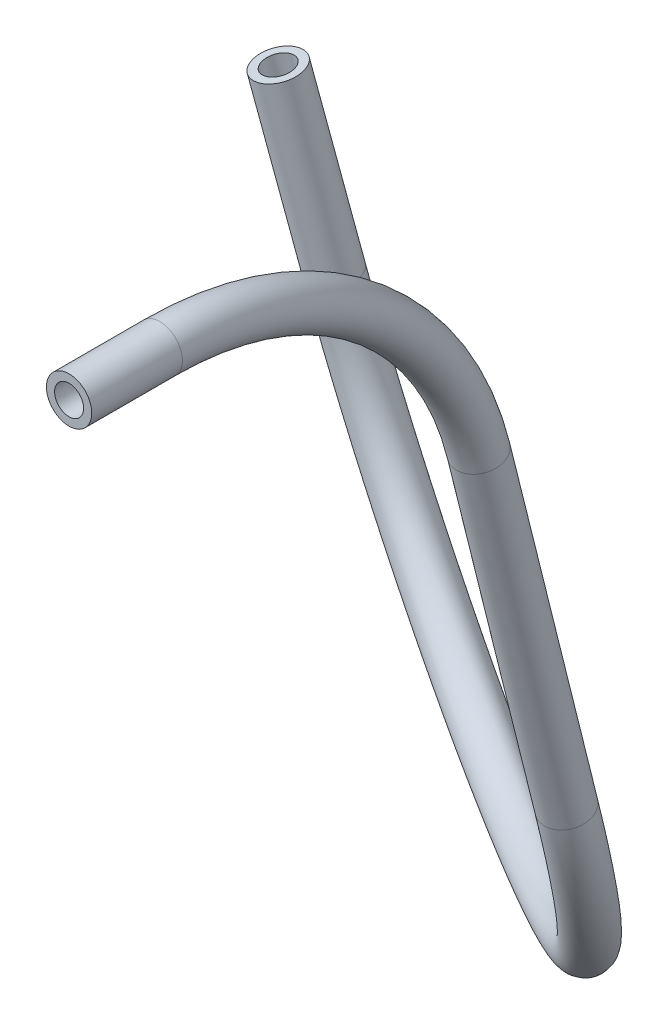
from build123d import *

# Parameters (mm, degrees)
SKETCH2_R           = 1.5875
SKETCH2_R_2         = 1.016
SKETCH5_R           = 1.5875
SKETCH5_R_2         = 1.016
REVOLVE1_ANGLE      = 169
SKETCH6_R           = 1.5875
SKETCH6_R_2         = 1.016
BOSS_EXTRUDE1_DEPTH = 12.7


with BuildPart() as part:
    # Sweep2: sweep along a path in Sketch1
    with BuildLine(Plane(origin=(0, 0, 0), x_dir=(0, 0, -1), z_dir=(1, 0, 0))) as sweep2_path:
        Line((34.829810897, -42.095521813), (28.684994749, -17.450010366))
        ThreePointArc((28.684994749, -17.450010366), (20.521757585, -4.879727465), (6.35, 0))
        Line((6.35, 0), (0, 0))
    # Sketch2 → Sweep2 (sweep)
    with BuildSketch(Plane.XY):
        Circle(SKETCH2_R)
        Circle(SKETCH2_R_2, mode=Mode.SUBTRACT)
    sweep(path=sweep2_path.line)

    # Sketch5 → Revolve1 (revolve)
    with BuildSketch(Plane(origin=(0, -47.807633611, -11.919781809), x_dir=(1, 0, 0), z_dir=(0, -0.9702957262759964, -0.24192189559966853))):
        with Locations(Location((0, -23.611388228, 0), (0, 0, 270))):
            Circle(SKETCH5_R)
        with Locations(Location((0, -23.611388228, 0), (0, 0, 270))):
            Circle(SKETCH5_R_2, mode=Mode.SUBTRACT)
    revolve(axis=Axis((-23.741853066, -40.948617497, -39.429792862), (0.4999999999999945, 0.20951050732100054, -0.840300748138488)), revolution_arc=REVOLVE1_ANGLE)

    # Sketch6 → Boss-Extrude1 (add)
    with BuildSketch(Plane(origin=(6.896979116, -40.717261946, -6.048078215), x_dir=(0.20132463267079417, -0.11046703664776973, 0.9732756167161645), z_dir=(-0.16524543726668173, 0.9755490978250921, 0.14490653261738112))):
        with Locations(Location((-59.79685796, -35.434984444, 0), (0, 0, 227.759186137))):
            Circle(SKETCH6_R)
        with Locations(Location((-59.79685796, -35.434984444, 0), (0, 0, 227.759186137))):
            Circle(SKETCH6_R_2, mode=Mode.SUBTRACT)
    extrude(amount=BOSS_EXTRUDE1_DEPTH)


solid = part.part
